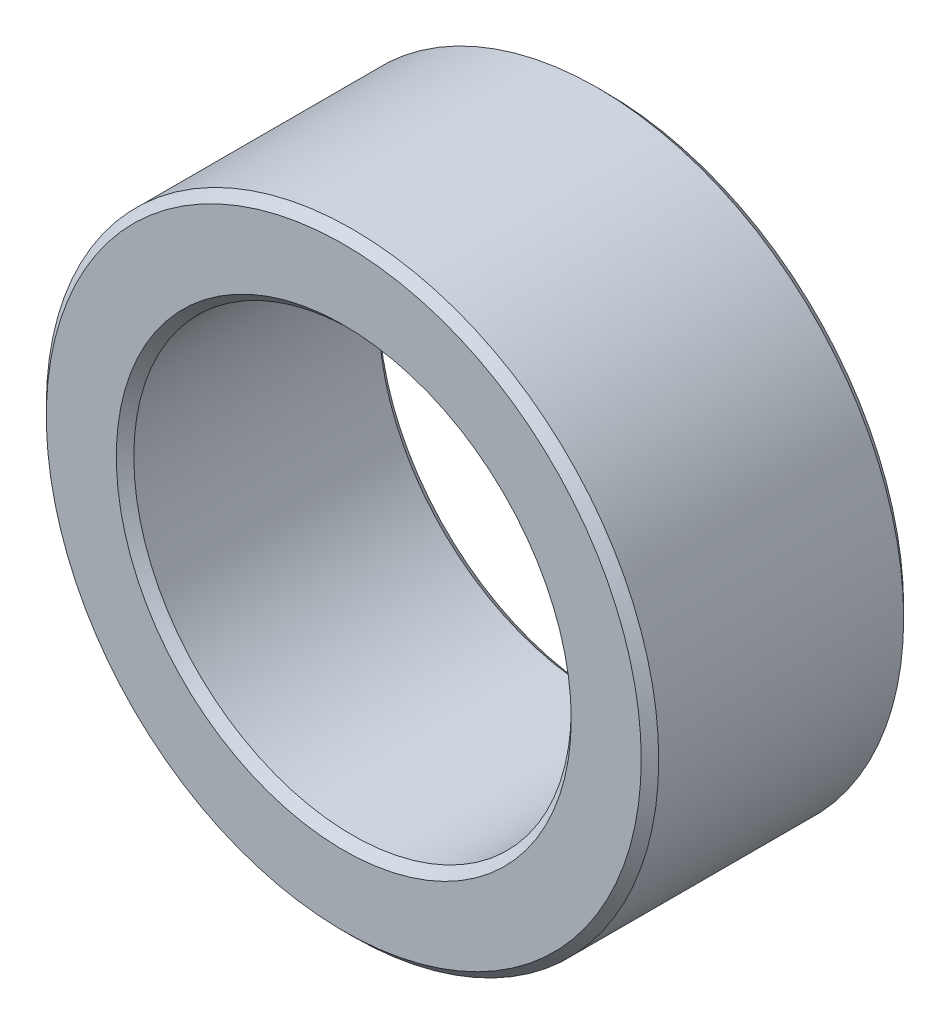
from build123d import *

# Parameters (mm, degrees)
ESQUISSE1_R      = 17.5
ESQUISSE1_R_2    = 12.5
EXTRUSION1_DEPTH = 15
CHANFREIN1_SIZE  = 0.5


with BuildPart() as part:
    # Esquisse1 → Extrusion1 (new body)
    with BuildSketch(Plane.XY):
        Circle(ESQUISSE1_R)
        Circle(ESQUISSE1_R_2, mode=Mode.SUBTRACT)
    extrude(amount=EXTRUSION1_DEPTH)

    # Chanfrein1
    chanfrein1_edges = [part.edges().sort_by_distance(p)[0] for p in [
        (-17.5, 0, 0),
        (-17.5, 0, 15),
        (-12.5, 0, 0),
        (-12.5, 0, 15),
    ]]
    chamfer(chanfrein1_edges, length=CHANFREIN1_SIZE)


solid = part.part
